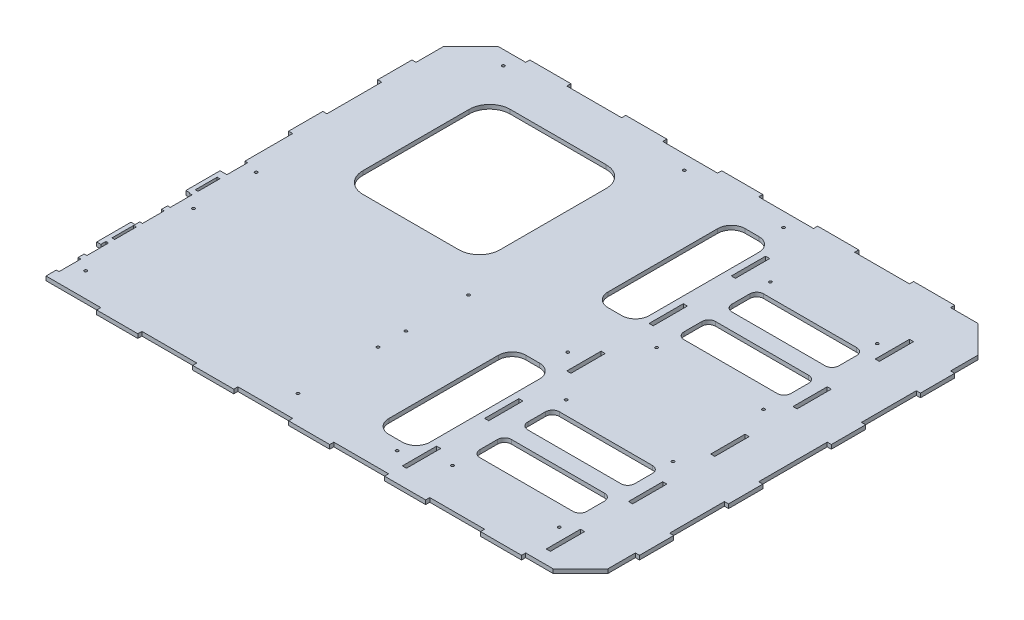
from build123d import *

# Parameters (mm, degrees)
SKETCH1_W           = 390
SKETCH1_H           = 310
BOSS_EXTRUDE1_DEPTH = 3
SKETCH2_W           = 30
SKETCH2_H           = 7
BOSS_EXTRUDE2_DEPTH = 3
SKETCH4_W           = 3
SKETCH4_H           = 25
BOSS_EXTRUDE3_DEPTH = 3
SKETCH7_R           = 1
CUT_EXTRUDE3_DEPTH  = 3
SKETCH9_W           = 30
SKETCH9_H           = 3
BOSS_EXTRUDE4_DEPTH = 3
CUT_EXTRUDE1_DEPTH  = 20
CUT_EXTRUDE4_DEPTH  = 3
SKETCH11_W          = 30
SKETCH11_H          = 100
CUT_EXTRUDE5_DEPTH  = 10
FILLET1_R           = 10
SKETCH12_W          = 3
SKETCH12_H          = 25
CUT_EXTRUDE6_DEPTH  = 503.42113809
SKETCH13_R          = 1
CUT_EXTRUDE7_DEPTH  = 10
SKETCH14_R          = 1
CUT_EXTRUDE8_DEPTH  = 503.42113809
SKETCH16_W          = 78
SKETCH16_H          = 23
CUT_EXTRUDE9_DEPTH  = 10
FILLET2_R           = 5
CUT_EXTRUDE10_DEPTH = 10
FILLET3_R           = 15
SKETCH19_W          = 2
SKETCH19_H          = 15.15
SKETCH19_H_2        = 15.9
CUT_EXTRUDE11_DEPTH = 503.42113809


with BuildPart() as part:
    # Sketch1 → Boss-Extrude1 (new body)
    with BuildSketch(Plane(origin=(0, 0, 0), x_dir=(1, 0, 0), z_dir=(0, 1, 0))):
        with Locations((195, 155)):
            Rectangle(SKETCH1_W, SKETCH1_H)
    extrude(amount=BOSS_EXTRUDE1_DEPTH)

    # Sketch2 → Boss-Extrude2 (add)
    with BuildSketch(Plane(origin=(0, 3, 0), x_dir=(1, 0, 0), z_dir=(0, 1, 0))):
        with Locations((55, 306.5)):
            Rectangle(SKETCH2_W, SKETCH2_H)
        with Locations((125, 306.5)):
            Rectangle(SKETCH2_W, SKETCH2_H)
        with Locations((195, 306.5)):
            Rectangle(SKETCH2_W, SKETCH2_H)
        with Locations((265, 306.5)):
            Rectangle(SKETCH2_W, SKETCH2_H)
        with Locations((335, 306.5)):
            Rectangle(SKETCH2_W, SKETCH2_H)
        with Locations((335, 3.5)):
            Rectangle(SKETCH2_W, SKETCH2_H)
        with Locations((265, 3.5)):
            Rectangle(SKETCH2_W, SKETCH2_H)
        with Locations((195, 3.5)):
            Rectangle(SKETCH2_W, SKETCH2_H)
        with Locations((125, 3.5)):
            Rectangle(SKETCH2_W, SKETCH2_H)
        with Locations((55, 3.5)):
            Rectangle(SKETCH2_W, SKETCH2_H)
    extrude(amount=-BOSS_EXTRUDE2_DEPTH)

    # Sketch4 → Boss-Extrude3 (add)
    with BuildSketch(Plane(origin=(0, 3, 0), x_dir=(1, 0, 0), z_dir=(0, 1, 0))):
        with Locations((-1.5, 257.5)):
            Rectangle(SKETCH4_W, SKETCH4_H)
        with Locations((-1.5, 192.5)):
            Rectangle(SKETCH4_W, SKETCH4_H)
        with Locations((-1.5, 52.5)):
            Rectangle(SKETCH4_W, SKETCH4_H)
        with Locations((-1.5, 117.5)):
            Rectangle(SKETCH4_W, SKETCH4_H)
        with Locations((391.5, 52.5)):
            Rectangle(SKETCH4_W, SKETCH4_H)
        with Locations((391.5, 117.5)):
            Rectangle(SKETCH4_W, SKETCH4_H)
        with Locations((391.5, 192.5)):
            Rectangle(SKETCH4_W, SKETCH4_H)
        with Locations((391.5, 257.5)):
            Rectangle(SKETCH4_W, SKETCH4_H)
    extrude(amount=-BOSS_EXTRUDE3_DEPTH)

    # Sketch7 → Cut-Extrude3 (cut)
    with BuildSketch(Plane(origin=(0, 3, 0), x_dir=(1, 0, 0), z_dir=(0, 1, 0))):
        with Locations(Location((166.1, 299.65, 0), (0, 0, 270))):
            Circle(SKETCH7_R)
        with Locations(Location((34.02, 299.65, 0), (0, 0, 270))):
            Circle(SKETCH7_R)
        with Locations(Location((11.16, 142.17, 0), (0, 0, 270))):
            Circle(SKETCH7_R)
        with Locations(Location((11.16, 96.45, 0), (0, 0, 270))):
            Circle(SKETCH7_R)
        with Locations(Location((11.16, 17.71, 0), (0, 0, 270))):
            Circle(SKETCH7_R)
        with Locations(Location((166.1, 17.71, 0), (0, 0, 270))):
            Circle(SKETCH7_R)
        with Locations(Location((166.1, 142.17, 0), (0, 0, 270))):
            Circle(SKETCH7_R)
        with Locations(Location((238.49, 299.65, 0), (0, 0, 270))):
            Circle(SKETCH7_R)
        with Locations(Location((238.49, 142.17, 0), (0, 0, 270))):
            Circle(SKETCH7_R)
        with Locations(Location((238.49, 17.71, 0), (0, 0, 270))):
            Circle(SKETCH7_R)
        with Locations(Location((166.1, 76.13, 0), (0, 0, 270))):
            Circle(SKETCH7_R)
        with Locations(Location((166.1, 96.45, 0), (0, 0, 270))):
            Circle(SKETCH7_R)
    extrude(amount=-CUT_EXTRUDE3_DEPTH, mode=Mode.SUBTRACT)

    # Sketch9 → Boss-Extrude4 (add)
    with BuildSketch(Plane(origin=(0, 3, 0), x_dir=(1, 0, 0), z_dir=(0, 1, 0))):
        with Locations((55, 311.5)):
            Rectangle(SKETCH9_W, SKETCH9_H)
        with Locations((125, 311.5)):
            Rectangle(SKETCH9_W, SKETCH9_H)
        with Locations((195, 311.5)):
            Rectangle(SKETCH9_W, SKETCH9_H)
        with Locations((265, 311.5)):
            Rectangle(SKETCH9_W, SKETCH9_H)
        with Locations((335, 311.5)):
            Rectangle(SKETCH9_W, SKETCH9_H)
        with Locations((335, -1.5)):
            Rectangle(SKETCH9_W, SKETCH9_H)
        with Locations((265, -1.5)):
            Rectangle(SKETCH9_W, SKETCH9_H)
        with Locations((195, -1.5)):
            Rectangle(SKETCH9_W, SKETCH9_H)
        with Locations((125, -1.5)):
            Rectangle(SKETCH9_W, SKETCH9_H)
        with Locations((55, -1.5)):
            Rectangle(SKETCH9_W, SKETCH9_H)
    extrude(amount=-BOSS_EXTRUDE4_DEPTH)

    # Sketch5 → Cut-Extrude1 (cut)
    with BuildSketch(Plane(origin=(0, 3, 0), x_dir=(1, 0, 0), z_dir=(0, 1, 0))):
        Polygon((370, 310), (390, 310), (390, 290), align=None)
        Polygon((390, 0), (390, 20), (370, 0), align=None)
    extrude(amount=-CUT_EXTRUDE1_DEPTH, mode=Mode.SUBTRACT)

    # Sketch10 → Cut-Extrude4 (cut)
    with BuildSketch(Plane(origin=(0, 3, 0), x_dir=(1, 0, 0), z_dir=(0, 1, 0))):
        Polygon((0, 310), (20, 310), (0, 290), align=None)
    extrude(amount=-CUT_EXTRUDE4_DEPTH, mode=Mode.SUBTRACT)

    # Sketch11 → Cut-Extrude5 (cut)
    with BuildSketch(Plane(origin=(0, 3, 0), x_dir=(1, 0, 0), z_dir=(0, 1, 0))):
        Polygon((232.55, 185), (215.1, 185), (215.1, 285), (245.1, 285), (245.1, 185), align=None)
        with Locations((230.1, 75)):
            Rectangle(SKETCH11_W, SKETCH11_H)
    extrude(amount=-CUT_EXTRUDE5_DEPTH, mode=Mode.SUBTRACT)

    # Fillet1
    fillet1_edges = [part.edges().sort_by_distance(p)[0] for p in [
        (245.1, 1.5, -185),
        (215.1, 1.5, -185),
        (215.1, 1.5, -285),
        (245.1, 1.5, -285),
        (215.1, 1.5, -25),
        (215.1, 1.5, -125),
        (245.1, 1.5, -125),
        (245.1, 1.5, -25),
    ]]
    fillet(fillet1_edges, radius=FILLET1_R)

    # Sketch12 → Cut-Extrude6 (cut, through all)
    with BuildSketch(Plane(origin=(0, 3, 0), x_dir=(1, 0, 0), z_dir=(0, 1, 0))):
        with Locations((251.5, 262.5)):
            Rectangle(SKETCH12_W, SKETCH12_H)
        with Locations((251.5, 202.5)):
            Rectangle(SKETCH12_W, SKETCH12_H)
        with Locations((251.5, 142.5)):
            Rectangle(SKETCH12_W, SKETCH12_H)
        with Locations((251.5, 82.5)):
            Rectangle(SKETCH12_W, SKETCH12_H)
        with Locations((251.5, 22.5)):
            Rectangle(SKETCH12_W, SKETCH12_H)
        with Locations((356.5, 22.5)):
            Rectangle(SKETCH12_W, SKETCH12_H)
        with Locations((356.5, 82.5)):
            Rectangle(SKETCH12_W, SKETCH12_H)
        with Locations((356.5, 142.5)):
            Rectangle(SKETCH12_W, SKETCH12_H)
        with Locations((356.5, 202.5)):
            Rectangle(SKETCH12_W, SKETCH12_H)
        with Locations((356.5, 262.5)):
            Rectangle(SKETCH12_W, SKETCH12_H)
    extrude(amount=-CUT_EXTRUDE6_DEPTH, mode=Mode.SUBTRACT)

    # Sketch13 → Cut-Extrude7 (cut)
    with BuildSketch(Plane(origin=(0, 3, 0), x_dir=(1, 0, 0), z_dir=(0, 1, 0))):
        with Locations(Location((268, 111.5, 0), (0, 0, 270))):
            Circle(SKETCH13_R)
        with Locations(Location((346, 111.5, 0), (0, 0, 270))):
            Circle(SKETCH13_R)
        with Locations(Location((268, 28.5, 0), (0, 0, 270))):
            Circle(SKETCH13_R)
        with Locations(Location((346, 28.5, 0), (0, 0, 270))):
            Circle(SKETCH13_R)
    extrude(amount=-CUT_EXTRUDE7_DEPTH, mode=Mode.SUBTRACT)

    # Sketch14 → Cut-Extrude8 (cut, through all)
    with BuildSketch(Plane(origin=(0, 3, 0), x_dir=(1, 0, 0), z_dir=(0, 1, 0))):
        with Locations(Location((268, 177.5, 0), (0, 0, 270))):
            Circle(SKETCH14_R)
        with Locations(Location((346, 177.5, 0), (0, 0, 270))):
            Circle(SKETCH14_R)
        with Locations(Location((268, 260.5, 0), (0, 0, 270))):
            Circle(SKETCH14_R)
        with Locations(Location((346, 260.5, 0), (0, 0, 270))):
            Circle(SKETCH14_R)
    extrude(amount=-CUT_EXTRUDE8_DEPTH, mode=Mode.SUBTRACT)

    # Sketch16 → Cut-Extrude9 (cut)
    with BuildSketch(Plane(origin=(0, 3, 0), x_dir=(1, 0, 0), z_dir=(0, 1, 0))):
        with Locations((307, 55)):
            Rectangle(SKETCH16_W, SKETCH16_H)
        with Locations((307, 90)):
            Rectangle(SKETCH16_W, SKETCH16_H)
        with Locations((307, 204)):
            Rectangle(SKETCH16_W, SKETCH16_H)
        with Locations((307, 239)):
            Rectangle(SKETCH16_W, SKETCH16_H)
    extrude(amount=-CUT_EXTRUDE9_DEPTH, mode=Mode.SUBTRACT)

    # Fillet2
    fillet2_edges = [part.edges().sort_by_distance(p)[0] for p in [
        (346, 1.5, -66.5),
        (346, 1.5, -43.5),
        (268, 1.5, -43.5),
        (268, 1.5, -66.5),
        (346, 1.5, -101.5),
        (346, 1.5, -78.5),
        (268, 1.5, -78.5),
        (268, 1.5, -101.5),
        (346, 1.5, -215.5),
        (346, 1.5, -192.5),
        (268, 1.5, -192.5),
        (268, 1.5, -215.5),
        (346, 1.5, -250.5),
        (346, 1.5, -227.5),
        (268, 1.5, -227.5),
        (268, 1.5, -250.5),
    ]]
    fillet(fillet2_edges, radius=FILLET2_R)

    # Sketch18 → Cut-Extrude10 (cut)
    with BuildSketch(Plane(origin=(0, 3, 0), x_dir=(1, 0, 0), z_dir=(0, 1, 0))):
        Polygon((99.06, 167.17), (149.06, 167.17), (149.06, 274.65), (49.06, 274.65), (49.06, 167.17), align=None)
    extrude(amount=-CUT_EXTRUDE10_DEPTH, mode=Mode.SUBTRACT)

    # Fillet3
    fillet3_edges = [part.edges().sort_by_distance(p)[0] for p in [
        (49.06, 1.5, -167.17),
        (49.06, 1.5, -274.65),
        (149.06, 1.5, -274.65),
        (149.06, 1.5, -167.17),
    ]]
    fillet(fillet3_edges, radius=FILLET3_R)

    # Sketch19 → Cut-Extrude11 (cut, through all)
    with BuildSketch(Plane(origin=(0, 3, 0), x_dir=(1, 0, 0), z_dir=(0, 1, 0))):
        with Locations((1, 137.575)):
            Rectangle(SKETCH19_W, SKETCH19_H)
        with Locations((1, 116.91)):
            Rectangle(SKETCH19_W, SKETCH19_H_2)
        with Locations((1, 96.62)):
            Rectangle(SKETCH19_W, SKETCH19_H_2)
        with Locations((1, 76.33)):
            Rectangle(SKETCH19_W, SKETCH19_H_2)
        with Locations((1, 15.46)):
            Rectangle(SKETCH19_W, SKETCH19_H_2)
        with Locations((1, 35.75)):
            Rectangle(SKETCH19_W, SKETCH19_H_2)
        with Locations((1, 56.04)):
            Rectangle(SKETCH19_W, SKETCH19_H_2)
    extrude(amount=-CUT_EXTRUDE11_DEPTH, mode=Mode.SUBTRACT)


solid = part.part
